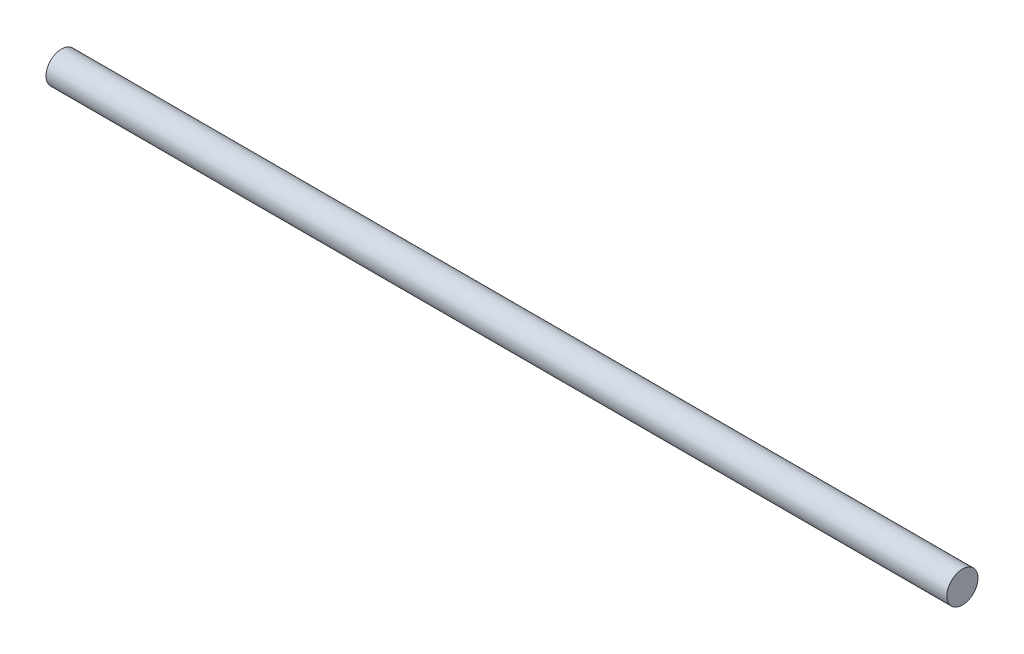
ISO-10303-21;
HEADER;
FILE_DESCRIPTION(('STEP AP214'),'2;1');
FILE_NAME('part.step','',(''),(''),'','','');
FILE_SCHEMA(('AUTOMOTIVE_DESIGN { 1 0 10303 214 1 1 1 1 }'));
ENDSEC;
DATA;
#1=APPLICATION_CONTEXT('core data for automotive mechanical design processes');
#2=APPLICATION_PROTOCOL_DEFINITION('international standard','automotive_design',2000,#1);
#3=PRODUCT_CONTEXT('',#1,'mechanical');
#4=PRODUCT('Part','Part','',(#3));
#5=PRODUCT_RELATED_PRODUCT_CATEGORY('part','',(#4));
#6=PRODUCT_DEFINITION_FORMATION('','',#4);
#7=PRODUCT_DEFINITION_CONTEXT('part definition',#1,'design');
#8=PRODUCT_DEFINITION('design','',#6,#7);
#9=PRODUCT_DEFINITION_SHAPE('','',#8);
#10=(LENGTH_UNIT() NAMED_UNIT(*) SI_UNIT(.MILLI.,.METRE.));
#11=(NAMED_UNIT(*) PLANE_ANGLE_UNIT() SI_UNIT($,.RADIAN.));
#12=(NAMED_UNIT(*) SI_UNIT($,.STERADIAN.) SOLID_ANGLE_UNIT());
#13=UNCERTAINTY_MEASURE_WITH_UNIT(LENGTH_MEASURE(1.E-05),#10,'distance_accuracy_value','');
#14=(GEOMETRIC_REPRESENTATION_CONTEXT(3) GLOBAL_UNCERTAINTY_ASSIGNED_CONTEXT((#13)) GLOBAL_UNIT_ASSIGNED_CONTEXT((#10,
#11,#12)) REPRESENTATION_CONTEXT('',''));
#15=CARTESIAN_POINT('',(0.,0.,0.));
#16=DIRECTION('',(0.,0.,1.));
#17=DIRECTION('',(1.,0.,0.));
#18=AXIS2_PLACEMENT_3D('',#15,#16,#17);
#19=CARTESIAN_POINT('',(550.164,0.,0.));
#20=DIRECTION('',(-1.,0.,0.));
#21=DIRECTION('',(0.,0.,1.));
#22=AXIS2_PLACEMENT_3D('',#19,#20,#21);
#23=CYLINDRICAL_SURFACE('',#22,9.525);
#24=CARTESIAN_POINT('',(550.164,0.,0.));
#25=DIRECTION('',(1.,0.,0.));
#26=DIRECTION('',(0.,0.,-1.));
#27=AXIS2_PLACEMENT_3D('',#24,#25,#26);
#28=CIRCLE('',#27,9.525);
#29=CARTESIAN_POINT('',(550.164,0.,-9.525));
#30=VERTEX_POINT('',#29);
#31=EDGE_CURVE('E10',#30,#30,#28,.T.);
#32=ORIENTED_EDGE('',*,*,#31,.F.);
#33=EDGE_LOOP('',(#32));
#34=FACE_BOUND('',#33,.T.);
#35=CARTESIAN_POINT('',(0.,0.,0.));
#36=DIRECTION('',(1.,0.,0.));
#37=DIRECTION('',(0.,0.,-1.));
#38=AXIS2_PLACEMENT_3D('',#35,#36,#37);
#39=CIRCLE('',#38,9.525);
#40=CARTESIAN_POINT('',(0.,0.,-9.525));
#41=VERTEX_POINT('',#40);
#42=EDGE_CURVE('E32',#41,#41,#39,.T.);
#43=ORIENTED_EDGE('',*,*,#42,.T.);
#44=EDGE_LOOP('',(#43));
#45=FACE_BOUND('',#44,.T.);
#46=ADVANCED_FACE('F29',(#34,#45),#23,.T.);
#47=CARTESIAN_POINT('',(550.164,0.,0.));
#48=DIRECTION('',(1.,0.,0.));
#49=DIRECTION('',(0.,0.,-1.));
#50=AXIS2_PLACEMENT_3D('',#47,#48,#49);
#51=PLANE('',#50);
#52=ORIENTED_EDGE('',*,*,#31,.T.);
#53=EDGE_LOOP('',(#52));
#54=FACE_BOUND('',#53,.T.);
#55=ADVANCED_FACE('F44',(#54),#51,.T.);
#56=CARTESIAN_POINT('',(0.,0.,0.));
#57=DIRECTION('',(1.,0.,0.));
#58=DIRECTION('',(0.,0.,-1.));
#59=AXIS2_PLACEMENT_3D('',#56,#57,#58);
#60=PLANE('',#59);
#61=ORIENTED_EDGE('',*,*,#42,.F.);
#62=EDGE_LOOP('',(#61));
#63=FACE_BOUND('',#62,.T.);
#64=ADVANCED_FACE('F42',(#63),#60,.F.);
#65=CLOSED_SHELL('',(#46,#55,#64));
#66=MANIFOLD_SOLID_BREP('B2',#65);
#67=ADVANCED_BREP_SHAPE_REPRESENTATION('',(#18,#66),#14);
#68=SHAPE_DEFINITION_REPRESENTATION(#9,#67);
ENDSEC;
END-ISO-10303-21;
